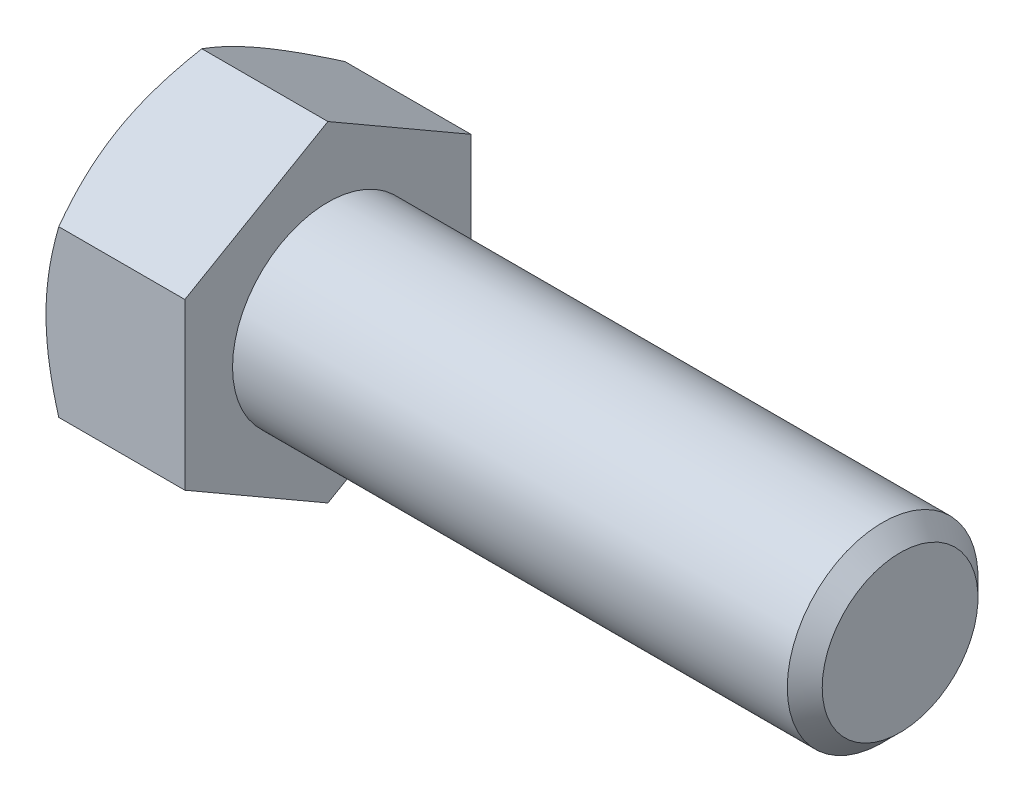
from build123d import *

# Parameters (mm, degrees)
BASEHEAD_DEPTH = 9.2456


with BuildPart() as part:
    # Sketch1 → BaseHead (new body)
    with BuildSketch(Plane(origin=(0, 0, 0), x_dir=(0, 0, -1), z_dir=(1, 0, 0))):
        Polygon((9.525, 5.499261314), (9.525, -5.499261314), (0, -10.998522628), (-9.525, -5.499261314), (-9.525, 5.499261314), (0, 10.998522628), align=None)
    extrude(amount=BASEHEAD_DEPTH)

    # BodySke → BaseBody (revolve)
    with BuildSketch(Plane.XY, mode=Mode.PRIVATE) as basebody_sk:
        Polygon((0, 0), (47.3456, 0), (47.3456, 5.18668), (46.18228, 6.35), (0, 6.35), align=None)
    revolve(basebody_sk.sketch.rotate(Axis((0, 0, 0), (1, 0, 0)), 90), axis=Axis((0, 0, 0), (1, 0, 0)))

    # Sketch3 → HeadChamfer (revolve, cut)
    with BuildSketch(Plane.XY):
        Polygon((0, 9.525), (4.516912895, 17.348522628), (4.516912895, 23.698522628), (-12.7, 23.698522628), (-12.7, 9.525), align=None)
    revolve(axis=Axis((0, 0, 0), (1, 0, 0)), mode=Mode.SUBTRACT)


solid = part.part
